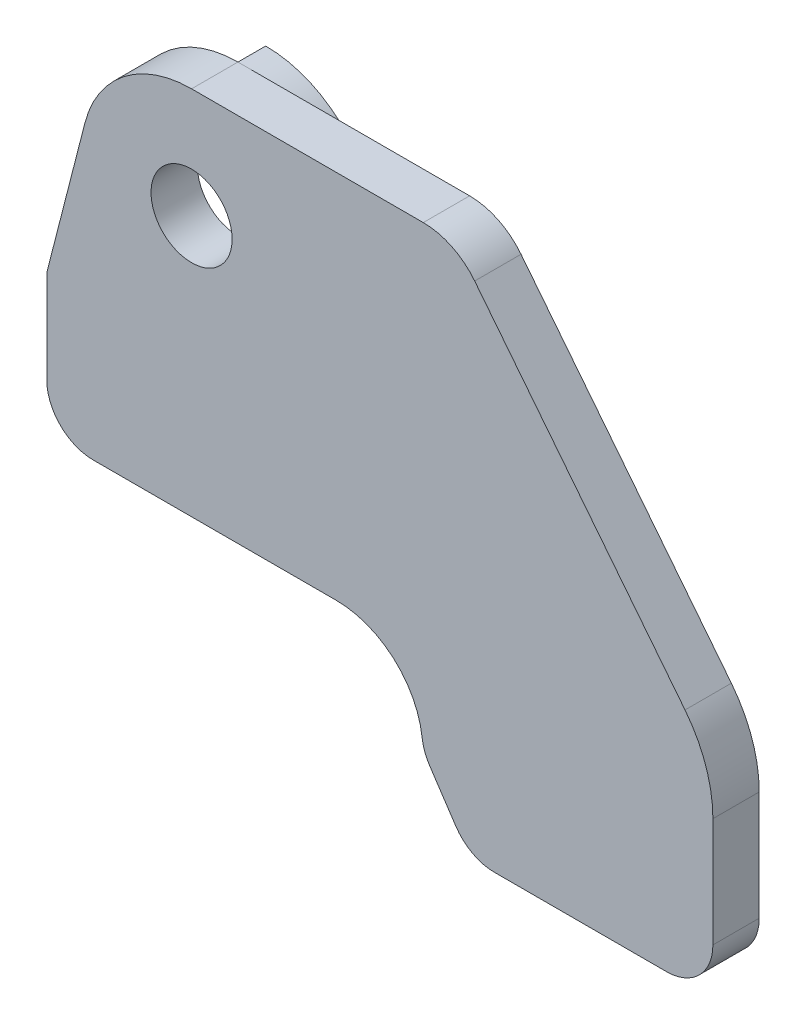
from build123d import *

# Parameters (mm, degrees)
SKETCH1_R           = 2.2225
BOSS_EXTRUDE1_DEPTH = 2.54
FILLET1_R           = 2.54
BOSS_EXTRUDE2_START = 1.524
BOSS_EXTRUDE2_DEPTH = 1.524


with BuildPart() as part:
    # Sketch1 → Boss-Extrude1 (new body)
    with BuildSketch(Plane.XY):
        with BuildLine():
            Line((-5.843258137, 1.499129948), (-7.9375, -6.663735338))
            Line((-7.9375, -6.663735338), (-7.9375, -14.283735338))
            Line((-7.9375, -14.283735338), (7.9375, -14.283735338))
            ThreePointArc((7.9375, -14.283735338), (11.283408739, -15.66773924), (12.673955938, -19.010933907))
            Line((12.673955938, -19.010933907), (15.24, -22.86))
            Line((15.24, -22.86), (28.575, -22.86))
            Line((28.575, -22.86), (28.575, -14.327159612))
            ThreePointArc((28.575, -14.327159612), (28.182249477, -11.999204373), (27.04747618, -9.928958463))
            Line((27.04747618, -9.928958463), (15.51798568, 4.667345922))
            ThreePointArc((15.51798568, 4.667345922), (14.265621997, 5.67324084), (12.7, 6.0325))
            Line((12.7, 6.0325), (0, 6.0325))
            ThreePointArc((0, 6.0325), (-3.69780711, 4.766264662), (-5.843258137, 1.499129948))
        make_face()
        Circle(SKETCH1_R, mode=Mode.SUBTRACT)
    extrude(amount=BOSS_EXTRUDE1_DEPTH)

    # Fillet1
    fillet1_edges = [part.edges().sort_by_distance(p)[0] for p in [
        (28.575, -22.86, 1.27),
        (15.24, -22.86, 1.27),
        (12.673955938, -19.010933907, 1.27),
        (-7.9375, -14.283735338, 1.27),
    ]]
    fillet(fillet1_edges, radius=FILLET1_R)

    # Sketch2 → Boss-Extrude2 (add)
    with BuildSketch(Plane(origin=(0, 0, 0), x_dir=(-1, 0, 0), z_dir=(0, 0, -1)).offset(BOSS_EXTRUDE2_START)):
        with BuildLine():
            Line((0, 6.0325), (0, 3.265632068))
            ThreePointArc((0, 3.265632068), (-2.116622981, 2.51643665), (-3.2385, 0.5715))
            Line((-3.2385, 0.5715), (-6.005367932, 0.5715))
            ThreePointArc((-6.005367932, 0.5715), (-4.0585393, 4.463105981), (0, 6.0325))
        make_face()
    extrude(amount=-BOSS_EXTRUDE2_DEPTH)


solid = part.part
